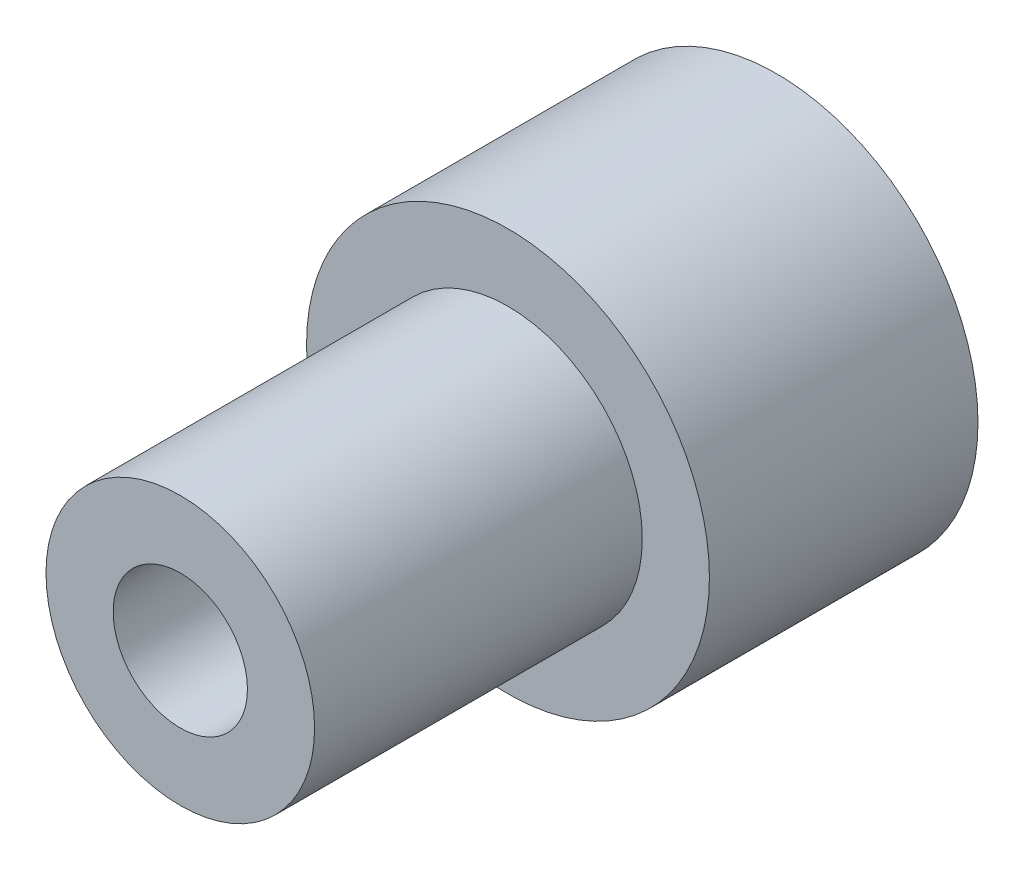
from build123d import *

# Parameters (mm, degrees)
SKETCH1_R           = 4.7625
BASE_EXTRUDE_DEPTH  = 6.35
SKETCH2_R           = 3.175
BOSS_EXTRUDE1_DEPTH = 7.747
SKETCH3_R           = 1.5875
CUT_EXTRUDE1_DEPTH  = 16.623322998
CUT_EXTRUDE2_DEPTH  = 3.683


with BuildPart() as part:
    # Sketch1 → Base-Extrude (new body)
    with BuildSketch(Plane.XY):
        Circle(SKETCH1_R)
    extrude(amount=BASE_EXTRUDE_DEPTH)

    # Sketch2 → Boss-Extrude1 (add)
    with BuildSketch(Plane.XY.offset(6.35)):
        Circle(SKETCH2_R)
    extrude(amount=BOSS_EXTRUDE1_DEPTH)

    # Sketch3 → Cut-Extrude1 (cut, through all)
    with BuildSketch(Plane.XY.offset(14.097)):
        Circle(SKETCH3_R)
    extrude(amount=-CUT_EXTRUDE1_DEPTH, mode=Mode.SUBTRACT)

    # Sketch4 → Cut-Extrude2 (cut)
    with BuildSketch(Plane(origin=(0, 0, 0), x_dir=(-1, 0, 0), z_dir=(0, 0, -1))):
        Polygon((2.38125, 1.374815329), (2.38125, -1.374815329), (0, -2.749630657), (-2.38125, -1.374815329), (-2.38125, 1.374815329), (0, 2.749630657), align=None)
    extrude(amount=-CUT_EXTRUDE2_DEPTH, mode=Mode.SUBTRACT)


solid = part.part
